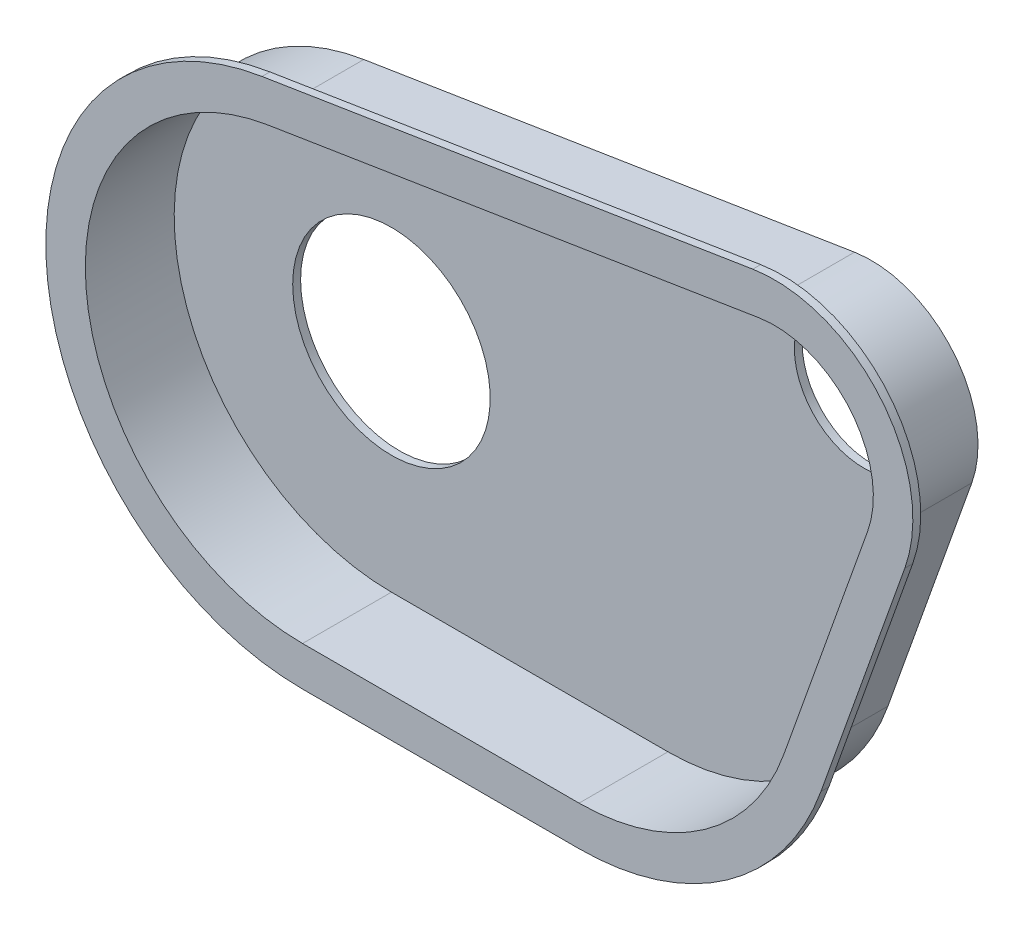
from build123d import *

# Parameters (mm, degrees)
BOSS_EXTRUDE1_DEPTH = 28.575
BOSS_EXTRUDE2_START = 2.54
SKETCH5_R           = 22.225
SKETCH5_R_2         = 31.75
BOSS_EXTRUDE2_DEPTH = 2.54
BOSS_EXTRUDE3_START = -2.54
BOSS_EXTRUDE3_DEPTH = 2.54


with BuildPart() as part:
    # Sketch1 → Boss-Extrude1 (new body)
    with BuildSketch(Plane.XY):
        with BuildLine():
            Line((146.345280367, 96.72128919), (-11.434859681, 71.481158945))
            ThreePointArc((-11.434859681, 71.481158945), (-72.162432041, -5.735460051), (0, -72.39))
            Line((0, -72.39), (88.9, -72.39))
            ThreePointArc((88.9, -72.39), (130.616027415, -59.161517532), (157.08575735, -24.31079173))
            Line((157.08575735, -24.31079173), (184.060309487, 51.346154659))
            ThreePointArc((184.060309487, 51.346154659), (178.131970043, 84.780229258), (146.345280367, 96.72128919))
        make_face()
        with BuildLine():
            Line((-11.033636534, 68.973048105), (146.746503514, 94.21317835))
            ThreePointArc((146.746503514, 94.21317835), (176.178623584, 83.156641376), (181.667826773, 52.199164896))
            Line((181.667826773, 52.199164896), (154.693274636, -23.457781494))
            ThreePointArc((154.693274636, -23.457781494), (129.152307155, -57.085674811), (88.9, -69.85))
            Line((88.9, -69.85), (0, -69.85))
            ThreePointArc((0, -69.85), (-69.630416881, -5.534215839), (-11.033636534, 68.973048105))
        make_face(mode=Mode.SUBTRACT)
    extrude(amount=BOSS_EXTRUDE1_DEPTH)

    # Sketch5 → Boss-Extrude2 (add)
    with BuildSketch(Plane(origin=(0, 0, 0), x_dir=(-1, 0, 0), z_dir=(0, 0, -1)).offset(BOSS_EXTRUDE2_START)):
        with BuildLine():
            Line((11.434859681, 71.481158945), (-146.345280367, 96.72128919))
            ThreePointArc((-146.345280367, 96.72128919), (-178.131970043, 84.780229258), (-184.060309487, 51.346154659))
            Line((-184.060309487, 51.346154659), (-157.08575735, -24.31079173))
            ThreePointArc((-157.08575735, -24.31079173), (-130.616027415, -59.161517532), (-88.9, -72.39))
            Line((-88.9, -72.39), (0, -72.39))
            ThreePointArc((0, -72.39), (72.162432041, -5.735460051), (11.434859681, 71.481158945))
        make_face()
        with Locations((-151.761792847, 62.861792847)):
            Circle(SKETCH5_R, mode=Mode.SUBTRACT)
        Circle(SKETCH5_R_2, mode=Mode.SUBTRACT)
    extrude(amount=-BOSS_EXTRUDE2_DEPTH)

    # Sketch6 → Boss-Extrude3 (add)
    with BuildSketch(Plane.XY.offset(28.575).offset(BOSS_EXTRUDE3_START)):
        with BuildLine():
            Line((-13.039752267, 81.513602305), (144.74038778, 106.75373255))
            ThreePointArc((144.74038778, 106.75373255), (185.945355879, 91.274580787), (193.630240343, 47.934113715))
            Line((193.630240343, 47.934113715), (166.655688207, -27.722832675))
            ThreePointArc((166.655688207, -27.722832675), (136.470908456, -67.464888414), (88.9, -82.55))
            Line((88.9, -82.55), (0, -82.55))
            ThreePointArc((0, -82.55), (-82.290492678, -6.5404369), (-13.039752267, 81.513602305))
        make_face()
        with BuildLine():
            Line((-11.434859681, 71.481158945), (146.345280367, 96.72128919))
            ThreePointArc((146.345280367, 96.72128919), (178.131970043, 84.780229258), (184.060309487, 51.346154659))
            Line((184.060309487, 51.346154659), (157.08575735, -24.31079173))
            ThreePointArc((157.08575735, -24.31079173), (130.616027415, -59.161517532), (88.9, -72.39))
            Line((88.9, -72.39), (0, -72.39))
            ThreePointArc((0, -72.39), (-72.162432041, -5.735460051), (-11.434859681, 71.481158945))
        make_face(mode=Mode.SUBTRACT)
    extrude(amount=BOSS_EXTRUDE3_DEPTH)


solid = part.part
